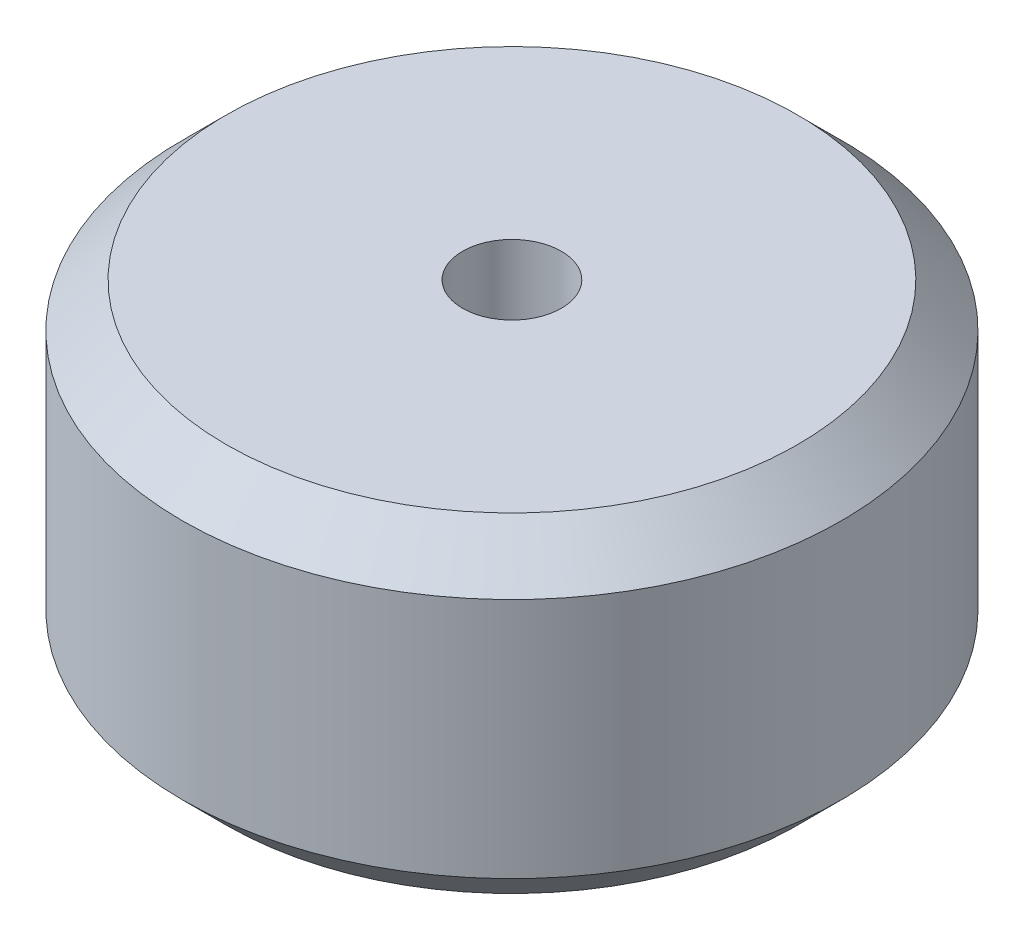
from build123d import *

# Parameters (mm, degrees)
SKETCH1_R      = 15
EXTRUDE1_DEPTH = 15
CHAMFER1_SIZE  = 2
SKETCH2_R      = 2.25
EXTRUDE2_DEPTH = 7.5


with BuildPart() as part:
    # Sketch1 → Extrude1 (new body)
    with BuildSketch(Plane(origin=(0, 0, 0), x_dir=(1, 0, 0), z_dir=(0, 1, 0))):
        with Locations(Location((0, 0, 0), (0, 0, 270))):
            Circle(SKETCH1_R)
    extrude(amount=EXTRUDE1_DEPTH)

    # Chamfer1
    chamfer1_edges = [part.edges().sort_by_distance(p)[0] for p in [
        (0, 0, -15),
        (0, 15, -15),
    ]]
    chamfer(chamfer1_edges, length=CHAMFER1_SIZE)

    # Sketch2 → Extrude2 (cut)
    with BuildSketch(Plane(origin=(0, 15, 0), x_dir=(1, 0, 0), z_dir=(0, 1, 0))):
        with Locations(Location((0, 0, 0), (0, 0, 270))):
            Circle(SKETCH2_R)
    extrude(amount=-EXTRUDE2_DEPTH, mode=Mode.SUBTRACT)


solid = part.part
